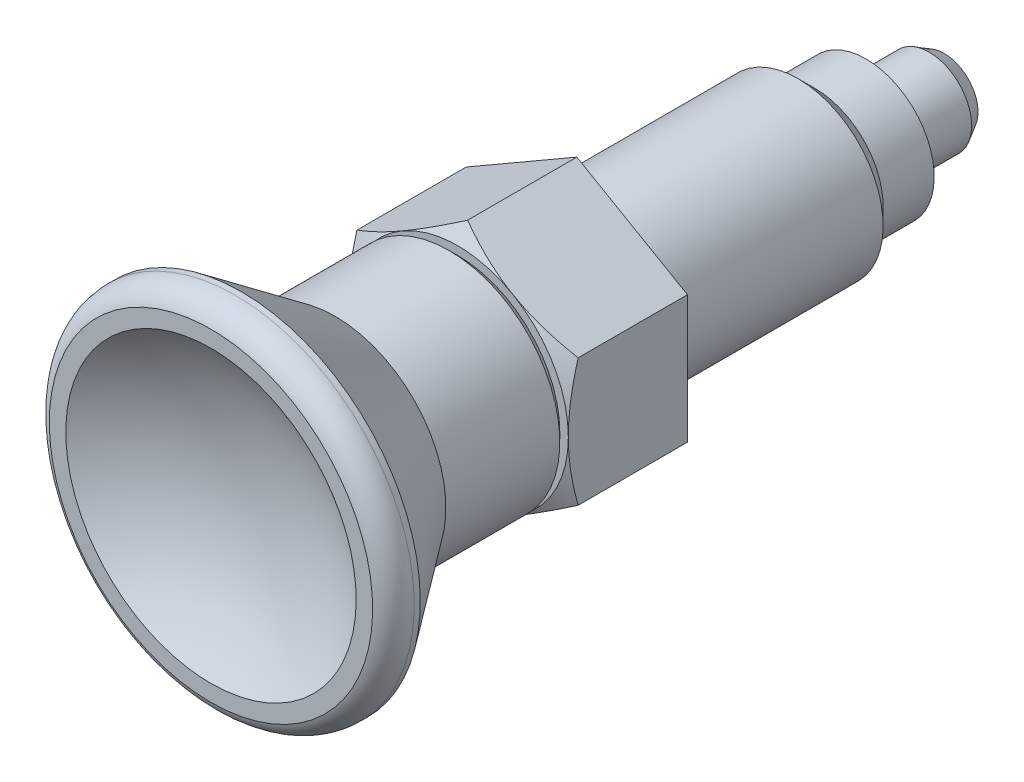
ISO-10303-21;
HEADER;
FILE_DESCRIPTION(('STEP AP214'),'2;1');
FILE_NAME('part.step','',(''),(''),'','','');
FILE_SCHEMA(('AUTOMOTIVE_DESIGN { 1 0 10303 214 1 1 1 1 }'));
ENDSEC;
DATA;
#1=APPLICATION_CONTEXT('core data for automotive mechanical design processes');
#2=APPLICATION_PROTOCOL_DEFINITION('international standard','automotive_design',2000,#1);
#3=PRODUCT_CONTEXT('',#1,'mechanical');
#4=PRODUCT('Part','Part','',(#3));
#5=PRODUCT_RELATED_PRODUCT_CATEGORY('part','',(#4));
#6=PRODUCT_DEFINITION_FORMATION('','',#4);
#7=PRODUCT_DEFINITION_CONTEXT('part definition',#1,'design');
#8=PRODUCT_DEFINITION('design','',#6,#7);
#9=PRODUCT_DEFINITION_SHAPE('','',#8);
#10=(LENGTH_UNIT() NAMED_UNIT(*) SI_UNIT(.MILLI.,.METRE.));
#11=(NAMED_UNIT(*) PLANE_ANGLE_UNIT() SI_UNIT($,.RADIAN.));
#12=(NAMED_UNIT(*) SI_UNIT($,.STERADIAN.) SOLID_ANGLE_UNIT());
#13=UNCERTAINTY_MEASURE_WITH_UNIT(LENGTH_MEASURE(1.E-05),#10,'distance_accuracy_value','');
#14=(GEOMETRIC_REPRESENTATION_CONTEXT(3) GLOBAL_UNCERTAINTY_ASSIGNED_CONTEXT((#13)) GLOBAL_UNIT_ASSIGNED_CONTEXT((#10,
#11,#12)) REPRESENTATION_CONTEXT('',''));
#15=CARTESIAN_POINT('',(0.,0.,0.));
#16=DIRECTION('',(0.,0.,1.));
#17=DIRECTION('',(1.,0.,0.));
#18=AXIS2_PLACEMENT_3D('',#15,#16,#17);
#19=CARTESIAN_POINT('',(0.,0.,32.6));
#20=DIRECTION('',(1.,0.,0.));
#21=DIRECTION('',(0.,-1.,0.));
#22=AXIS2_PLACEMENT_3D('',#19,#20,#21);
#23=SPHERICAL_SURFACE('',#22,14.);
#24=CARTESIAN_POINT('',(0.,-8.53170557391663,21.5));
#25=CARTESIAN_POINT('',(0.239701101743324,-8.53170729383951,21.5));
#26=CARTESIAN_POINT('',(0.479373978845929,-8.52159969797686,21.5));
#27=CARTESIAN_POINT('',(0.957096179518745,-8.48123987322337,21.5));
#28=CARTESIAN_POINT('',(1.19514505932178,-8.45098234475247,21.5));
#29=CARTESIAN_POINT('',(1.66809840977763,-8.37048717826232,21.5));
#30=CARTESIAN_POINT('',(1.90299924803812,-8.3202282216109,21.5));
#31=CARTESIAN_POINT('',(2.36773233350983,-8.20008811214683,21.5));
#32=CARTESIAN_POINT('',(2.59756451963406,-8.13020672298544,21.5));
#33=CARTESIAN_POINT('',(3.05040854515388,-7.97135842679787,21.5));
#34=CARTESIAN_POINT('',(3.27342368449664,-7.88240092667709,21.5));
#35=CARTESIAN_POINT('',(3.71116976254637,-7.68601114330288,21.5));
#36=CARTESIAN_POINT('',(3.92590057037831,-7.5785785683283,21.5));
#37=CARTESIAN_POINT('',(4.34545679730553,-7.34605366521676,21.5));
#38=CARTESIAN_POINT('',(4.55028643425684,-7.22096894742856,21.5));
#39=CARTESIAN_POINT('',(4.94875279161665,-6.95394741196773,21.5));
#40=CARTESIAN_POINT('',(5.14238561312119,-6.81200477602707,21.5));
#41=CARTESIAN_POINT('',(5.51699044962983,-6.51232267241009,21.5));
#42=CARTESIAN_POINT('',(5.69796342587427,-6.35458440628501,21.5));
#43=CARTESIAN_POINT('',(6.04598097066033,-6.0244208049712,21.5));
#44=CARTESIAN_POINT('',(6.21302532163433,-5.85199524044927,21.5));
#45=CARTESIAN_POINT('',(6.53199815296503,-5.49368132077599,21.5));
#46=CARTESIAN_POINT('',(6.6839263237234,-5.30779269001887,21.5));
#47=CARTESIAN_POINT('',(6.97158596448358,-4.92387306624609,21.5));
#48=CARTESIAN_POINT('',(7.10731707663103,-4.72584180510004,21.5));
#49=CARTESIAN_POINT('',(7.36158785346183,-4.31908993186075,21.5));
#50=CARTESIAN_POINT('',(7.48013099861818,-4.11037149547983,21.5));
#51=CARTESIAN_POINT('',(7.69925411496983,-3.68361770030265,21.5));
#52=CARTESIAN_POINT('',(7.79982785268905,-3.46557914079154,21.5));
#53=CARTESIAN_POINT('',(7.98222972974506,-3.02184395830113,21.5));
#54=CARTESIAN_POINT('',(8.06406129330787,-2.79614874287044,21.5));
#55=CARTESIAN_POINT('',(8.20842175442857,-2.33866337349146,21.5));
#56=CARTESIAN_POINT('',(8.27095035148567,-2.10687312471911,21.5));
#57=CARTESIAN_POINT('',(8.37625770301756,-1.63885297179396,21.5));
#58=CARTESIAN_POINT('',(8.41903679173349,-1.40262314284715,21.5));
#59=CARTESIAN_POINT('',(8.48454328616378,-0.927394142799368,21.5));
#60=CARTESIAN_POINT('',(8.5072702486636,-0.688394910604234,21.5));
#61=CARTESIAN_POINT('',(8.53250695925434,-0.209376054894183,21.5));
#62=CARTESIAN_POINT('',(8.53502046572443,0.0306433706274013,21.5));
#63=CARTESIAN_POINT('',(8.5198196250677,0.510124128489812,21.5));
#64=CARTESIAN_POINT('',(8.50209827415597,0.749585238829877,21.5));
#65=CARTESIAN_POINT('',(8.44654739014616,1.22611973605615,21.5));
#66=CARTESIAN_POINT('',(8.40872148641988,1.46319354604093,21.5));
#67=CARTESIAN_POINT('',(8.31323191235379,1.93331562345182,21.5));
#68=CARTESIAN_POINT('',(8.25556793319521,2.16636382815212,21.5));
#69=CARTESIAN_POINT('',(8.12081350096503,2.62676991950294,21.5));
#70=CARTESIAN_POINT('',(8.04372339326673,2.85412790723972,21.5));
#71=CARTESIAN_POINT('',(7.87066231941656,3.30154649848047,21.5));
#72=CARTESIAN_POINT('',(7.77469093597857,3.52160694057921,21.5));
#73=CARTESIAN_POINT('',(7.56457013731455,3.95282077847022,21.5));
#74=CARTESIAN_POINT('',(7.45042407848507,4.16397580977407,21.5));
#75=CARTESIAN_POINT('',(7.20470986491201,4.57599267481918,21.5));
#76=CARTESIAN_POINT('',(7.07313569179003,4.77685091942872,21.5));
#77=CARTESIAN_POINT('',(6.79355690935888,5.16673175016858,21.5));
#78=CARTESIAN_POINT('',(6.64555528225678,5.35575647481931,21.5));
#79=CARTESIAN_POINT('',(6.33415193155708,5.72066897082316,21.5));
#80=CARTESIAN_POINT('',(6.17074996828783,5.89655653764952,21.5));
#81=CARTESIAN_POINT('',(5.82971281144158,6.23393780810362,21.5));
#82=CARTESIAN_POINT('',(5.65207788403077,6.3954317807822,21.5));
#83=CARTESIAN_POINT('',(5.28383088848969,6.70288487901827,21.5));
#84=CARTESIAN_POINT('',(5.09321853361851,6.84884366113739,21.5));
#85=CARTESIAN_POINT('',(4.70041160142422,7.1241591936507,21.5));
#86=CARTESIAN_POINT('',(4.49821916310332,7.25351899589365,21.5));
#87=CARTESIAN_POINT('',(4.08358517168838,7.49479054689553,21.5));
#88=CARTESIAN_POINT('',(3.87114009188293,7.60669623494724,21.5));
#89=CARTESIAN_POINT('',(3.43761429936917,7.81219183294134,21.5));
#90=CARTESIAN_POINT('',(3.2165350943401,7.90578492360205,21.5));
#91=CARTESIAN_POINT('',(2.76727776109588,8.07401431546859,21.5));
#92=CARTESIAN_POINT('',(2.53909962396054,8.14865059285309,21.5));
#93=CARTESIAN_POINT('',(2.07727024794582,8.27843463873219,21.5));
#94=CARTESIAN_POINT('',(1.84361908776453,8.33358268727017,21.5));
#95=CARTESIAN_POINT('',(1.37249510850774,8.42400095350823,21.5));
#96=CARTESIAN_POINT('',(1.13502218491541,8.45927062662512,21.5));
#97=CARTESIAN_POINT('',(0.657949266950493,8.50967905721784,21.5));
#98=CARTESIAN_POINT('',(0.4183492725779,8.52481781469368,21.5));
#99=CARTESIAN_POINT('',(-0.0612677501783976,8.53485664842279,21.5));
#100=CARTESIAN_POINT('',(-0.301284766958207,8.52975727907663,21.5));
#101=CARTESIAN_POINT('',(-0.780039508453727,8.49935713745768,21.5));
#102=CARTESIAN_POINT('',(-1.01877721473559,8.47405607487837,21.5));
#103=CARTESIAN_POINT('',(-1.49327224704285,8.40343211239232,21.5));
#104=CARTESIAN_POINT('',(-1.72902957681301,8.3581092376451,21.5));
#105=CARTESIAN_POINT('',(-2.19592874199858,8.24775425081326,21.5));
#106=CARTESIAN_POINT('',(-2.42706976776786,8.18271871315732,21.5));
#107=CARTESIAN_POINT('',(-2.88297114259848,8.03342958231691,21.5));
#108=CARTESIAN_POINT('',(-3.10773367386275,7.94918265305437,21.5));
#109=CARTESIAN_POINT('',(-3.54940485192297,7.76203966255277,21.5));
#110=CARTESIAN_POINT('',(-3.76631204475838,7.65914016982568,21.5));
#111=CARTESIAN_POINT('',(-4.19068207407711,7.43543649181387,21.5));
#112=CARTESIAN_POINT('',(-4.39814511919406,7.31463270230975,21.5));
#113=CARTESIAN_POINT('',(-4.8021608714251,7.0559751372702,21.5));
#114=CARTESIAN_POINT('',(-4.99871337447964,6.91812104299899,21.5));
#115=CARTESIAN_POINT('',(-5.37950346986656,6.62634702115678,21.5));
#116=CARTESIAN_POINT('',(-5.56374125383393,6.47242734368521,21.5));
#117=CARTESIAN_POINT('',(-5.91862768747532,6.14958531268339,21.5));
#118=CARTESIAN_POINT('',(-6.08927386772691,5.9806602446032,21.5));
#119=CARTESIAN_POINT('',(-6.41566976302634,5.62909362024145,21.5));
#120=CARTESIAN_POINT('',(-6.57142461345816,5.44645683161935,21.5));
#121=CARTESIAN_POINT('',(-6.86702506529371,5.06867846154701,21.5));
#122=CARTESIAN_POINT('',(-7.00686772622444,4.873534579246,21.5));
#123=CARTESIAN_POINT('',(-7.26961345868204,4.47216416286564,21.5));
#124=CARTESIAN_POINT('',(-7.39251690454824,4.26593787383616,21.5));
#125=CARTESIAN_POINT('',(-7.62051616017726,3.84386102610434,21.5));
#126=CARTESIAN_POINT('',(-7.72561165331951,3.62801029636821,21.5));
#127=CARTESIAN_POINT('',(-7.917243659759,3.18822603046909,21.5));
#128=CARTESIAN_POINT('',(-8.00378046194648,2.96429262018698,21.5));
#129=CARTESIAN_POINT('',(-8.15769585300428,2.5098907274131,21.5));
#130=CARTESIAN_POINT('',(-8.22507098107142,2.27942107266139,21.5));
#131=CARTESIAN_POINT('',(-8.34014309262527,1.81370520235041,21.5));
#132=CARTESIAN_POINT('',(-8.38784687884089,1.57846066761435,21.5));
#133=CARTESIAN_POINT('',(-8.46327786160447,1.10474543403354,21.5));
#134=CARTESIAN_POINT('',(-8.49100134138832,0.866274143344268,21.5));
#135=CARTESIAN_POINT('',(-8.52625974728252,0.387849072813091,21.5));
#136=CARTESIAN_POINT('',(-8.53379511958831,0.147895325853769,21.5));
#137=CARTESIAN_POINT('',(-8.5286249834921,-0.331798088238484,21.5));
#138=CARTESIAN_POINT('',(-8.51591913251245,-0.571537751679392,21.5));
#139=CARTESIAN_POINT('',(-8.4703566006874,-1.04909074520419,21.5));
#140=CARTESIAN_POINT('',(-8.43750023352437,-1.28690410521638,21.5));
#141=CARTESIAN_POINT('',(-8.35186267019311,-1.75896084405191,21.5));
#142=CARTESIAN_POINT('',(-8.29907783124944,-1.99320356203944,21.5));
#143=CARTESIAN_POINT('',(-8.17398097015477,-2.45632829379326,21.5));
#144=CARTESIAN_POINT('',(-8.10167571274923,-2.68521213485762,21.5));
#145=CARTESIAN_POINT('',(-7.93802712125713,-3.1361221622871,21.5));
#146=CARTESIAN_POINT('',(-7.84667992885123,-3.35814694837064,21.5));
#147=CARTESIAN_POINT('',(-7.64560805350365,-3.79370687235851,21.5));
#148=CARTESIAN_POINT('',(-7.53588377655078,-4.00724219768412,21.5));
#149=CARTESIAN_POINT('',(-7.29883882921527,-4.42430601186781,21.5));
#150=CARTESIAN_POINT('',(-7.1715185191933,-4.62783470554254,21.5));
#151=CARTESIAN_POINT('',(-6.90018708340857,-5.02343989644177,21.5));
#152=CARTESIAN_POINT('',(-6.75617621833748,-5.21551657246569,21.5));
#153=CARTESIAN_POINT('',(-6.45247425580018,-5.58686986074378,21.5));
#154=CARTESIAN_POINT('',(-6.29278196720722,-5.76614549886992,21.5));
#155=CARTESIAN_POINT('',(-5.95891965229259,-6.11054627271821,21.5));
#156=CARTESIAN_POINT('',(-5.78475465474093,-6.2756762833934,21.5));
#157=CARTESIAN_POINT('',(-5.42305871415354,-6.5907497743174,21.5));
#158=CARTESIAN_POINT('',(-5.23552205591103,-6.74068669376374,21.5));
#159=CARTESIAN_POINT('',(-4.84848604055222,-7.02422451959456,21.5));
#160=CARTESIAN_POINT('',(-4.64898687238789,-7.15782568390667,21.5));
#161=CARTESIAN_POINT('',(-4.23934049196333,-7.4078063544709,21.5));
#162=CARTESIAN_POINT('',(-4.02918808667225,-7.5241773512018,21.5));
#163=CARTESIAN_POINT('',(-3.59982553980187,-7.73878930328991,21.5));
#164=CARTESIAN_POINT('',(-3.38061550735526,-7.83703047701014,21.5));
#165=CARTESIAN_POINT('',(-2.93492880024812,-8.01459089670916,21.5));
#166=CARTESIAN_POINT('',(-2.7084601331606,-8.09393023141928,21.5));
#167=CARTESIAN_POINT('',(-2.24972197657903,-8.23323823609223,21.5));
#168=CARTESIAN_POINT('',(-2.01745402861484,-8.29321199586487,21.5));
#169=CARTESIAN_POINT('',(-1.49030380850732,-8.40586518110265,21.5));
#170=CARTESIAN_POINT('',(-1.1942237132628,-8.45301528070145,21.5));
#171=CARTESIAN_POINT('',(-0.598747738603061,-8.51593440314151,21.5));
#172=CARTESIAN_POINT('',(-0.29935185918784,-8.53170342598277,21.5));
#173=CARTESIAN_POINT('',(0.,-8.53170557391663,21.5));
#174=B_SPLINE_CURVE_WITH_KNOTS('',3,(#24,#25,#26,#27,#28,#29,#30,#31,#32,#33,#34,#35,#36,#37,
#38,#39,#40,#41,#42,#43,#44,#45,#46,#47,#48,#49,#50,#51,#52,#53,#54,#55,#56,#57,#58,#59,#60,#61,
#62,#63,#64,#65,#66,#67,#68,#69,#70,#71,#72,#73,#74,#75,#76,#77,#78,#79,#80,#81,#82,#83,#84,#85,
#86,#87,#88,#89,#90,#91,#92,#93,#94,#95,#96,#97,#98,#99,#100,#101,#102,#103,#104,#105,#106,#107,
#108,#109,#110,#111,#112,#113,#114,#115,#116,#117,#118,#119,#120,#121,#122,#123,#124,#125,#126,
#127,#128,#129,#130,#131,#132,#133,#134,#135,#136,#137,#138,#139,#140,#141,#142,#143,#144,#145,
#146,#147,#148,#149,#150,#151,#152,#153,#154,#155,#156,#157,#158,#159,#160,#161,#162,#163,#164,
#165,#166,#167,#168,#169,#170,#171,#172,#173),.UNSPECIFIED.,.T.,.F.,(4,2,2,2,2,2,2,2,2,2,2,2,2,
2,2,2,2,2,2,2,2,2,2,2,2,2,2,2,2,2,2,2,2,2,2,2,2,2,2,2,2,2,2,2,2,2,2,2,2,2,2,2,2,2,2,2,2,2,2,2,2,
2,2,2,2,2,2,2,2,2,2,2,2,2,4),(0.,0.718841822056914,1.43787277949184,2.15767218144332,
2.87748025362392,3.59693418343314,4.31639947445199,5.03555552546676,5.75496050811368,
6.47431080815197,7.19367234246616,7.9130486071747,8.63244076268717,9.35168704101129,
10.0711823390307,10.790546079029,11.5099210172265,12.2292837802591,12.9486624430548,
13.6679073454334,14.387401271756,15.1067653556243,15.8261406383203,16.5455031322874,
17.2648815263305,17.9841272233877,18.7036219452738,19.422986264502,20.1423617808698,
20.8617238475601,21.5811018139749,22.3003473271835,23.0198420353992,23.7392116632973,
24.4585821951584,25.1779423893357,25.8973222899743,26.616702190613,27.3360623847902,
28.0554329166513,28.7748025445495,29.4942972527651,30.2135427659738,30.9329207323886,
31.6522827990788,32.3716583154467,33.0910226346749,33.8105173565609,34.5297630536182,
35.2491414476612,35.9685039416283,36.6878792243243,37.4072433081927,38.1267372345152,
38.8459821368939,39.5653607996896,40.2847235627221,41.0040985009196,41.7234622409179,
42.4429575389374,43.1622038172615,43.8815959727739,44.6009722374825,45.3203337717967,
46.039684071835,46.7590890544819,47.4782451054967,48.1977103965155,48.9171643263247,
49.6369723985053,50.3567718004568,51.0758027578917,51.7946445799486,52.6923736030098,
53.5901026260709),.UNSPECIFIED.);
#175=CARTESIAN_POINT('',(0.,-8.53170557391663,21.5));
#176=VERTEX_POINT('',#175);
#177=EDGE_CURVE('E19',#176,#176,#174,.T.);
#178=ORIENTED_EDGE('',*,*,#177,.T.);
#179=EDGE_LOOP('',(#178));
#180=FACE_BOUND('',#179,.T.);
#181=ADVANCED_FACE('F14',(#180),#23,.F.);
#182=CARTESIAN_POINT('',(-8.53170557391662,0.,21.5));
#183=DIRECTION('',(0.,0.,-1.));
#184=DIRECTION('',(0.,-1.,0.));
#185=AXIS2_PLACEMENT_3D('',#182,#183,#184);
#186=PLANE('',#185);
#187=ORIENTED_EDGE('',*,*,#177,.F.);
#188=EDGE_LOOP('',(#187));
#189=FACE_BOUND('',#188,.T.);
#190=CARTESIAN_POINT('',(0.,0.,21.5));
#191=DIRECTION('',(0.,0.,-1.));
#192=DIRECTION('',(0.,-1.,0.));
#193=AXIS2_PLACEMENT_3D('',#190,#191,#192);
#194=CIRCLE('',#193,9.50000000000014);
#195=CARTESIAN_POINT('',(0.,-9.50000000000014,21.5));
#196=VERTEX_POINT('',#195);
#197=EDGE_CURVE('E422',#196,#196,#194,.T.);
#198=ORIENTED_EDGE('',*,*,#197,.F.);
#199=EDGE_LOOP('',(#198));
#200=FACE_BOUND('',#199,.T.);
#201=ADVANCED_FACE('F357',(#189,#200),#186,.F.);
#202=CARTESIAN_POINT('',(0.,0.,-17.));
#203=DIRECTION('',(1.,0.,0.));
#204=DIRECTION('',(0.,-1.,0.));
#205=AXIS2_PLACEMENT_3D('',#202,#203,#204);
#206=SPHERICAL_SURFACE('',#205,4.9999999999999);
#207=CARTESIAN_POINT('',(0.,0.,-21.5881225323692));
#208=DIRECTION('',(0.,0.,1.));
#209=DIRECTION('',(0.,1.,0.));
#210=AXIS2_PLACEMENT_3D('',#207,#208,#209);
#211=CIRCLE('',#210,1.9872422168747);
#212=CARTESIAN_POINT('',(0.,1.9872422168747,-21.5881225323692));
#213=VERTEX_POINT('',#212);
#214=EDGE_CURVE('E341',#213,#213,#211,.T.);
#215=ORIENTED_EDGE('',*,*,#214,.F.);
#216=EDGE_LOOP('',(#215));
#217=FACE_BOUND('',#216,.T.);
#218=ADVANCED_FACE('F353',(#217),#206,.T.);
#219=CARTESIAN_POINT('',(0.,0.,20.0857085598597));
#220=DIRECTION('',(0.,0.,-1.));
#221=DIRECTION('',(0.,-1.,0.));
#222=AXIS2_PLACEMENT_3D('',#219,#220,#221);
#223=TOROIDAL_SURFACE('',#222,9.0002203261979,1.5);
#224=CARTESIAN_POINT('',(0.,0.,20.06));
#225=DIRECTION('',(0.,0.,1.));
#226=DIRECTION('',(0.,1.,0.));
#227=AXIS2_PLACEMENT_3D('',#224,#225,#226);
#228=CIRCLE('',#227,10.5);
#229=CARTESIAN_POINT('',(0.,10.5,20.06));
#230=VERTEX_POINT('',#229);
#231=EDGE_CURVE('E336',#230,#230,#228,.F.);
#232=ORIENTED_EDGE('',*,*,#231,.F.);
#233=EDGE_LOOP('',(#232));
#234=FACE_BOUND('',#233,.T.);
#235=ORIENTED_EDGE('',*,*,#197,.T.);
#236=EDGE_LOOP('',(#235));
#237=FACE_BOUND('',#236,.T.);
#238=ADVANCED_FACE('F348',(#234,#237),#223,.T.);
#239=CARTESIAN_POINT('',(0.,0.,-20.7000000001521));
#240=DIRECTION('',(0.,0.,1.));
#241=DIRECTION('',(0.,1.,0.));
#242=AXIS2_PLACEMENT_3D('',#239,#240,#241);
#243=CONICAL_SURFACE('',#242,2.49999999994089,0.523598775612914);
#244=CARTESIAN_POINT('',(0.,0.,-20.7));
#245=DIRECTION('',(0.,0.,1.));
#246=DIRECTION('',(0.,1.,0.));
#247=AXIS2_PLACEMENT_3D('',#244,#245,#246);
#248=CIRCLE('',#247,2.5);
#249=CARTESIAN_POINT('',(0.,2.5,-20.7));
#250=VERTEX_POINT('',#249);
#251=EDGE_CURVE('E331',#250,#250,#248,.T.);
#252=ORIENTED_EDGE('',*,*,#251,.F.);
#253=EDGE_LOOP('',(#252));
#254=FACE_BOUND('',#253,.T.);
#255=ORIENTED_EDGE('',*,*,#214,.T.);
#256=EDGE_LOOP('',(#255));
#257=FACE_BOUND('',#256,.T.);
#258=ADVANCED_FACE('F352',(#254,#257),#243,.T.);
#259=CARTESIAN_POINT('',(0.,0.,-22.));
#260=DIRECTION('',(0.,0.,1.));
#261=DIRECTION('',(0.,1.,0.));
#262=AXIS2_PLACEMENT_3D('',#259,#260,#261);
#263=CYLINDRICAL_SURFACE('',#262,10.5);
#264=ORIENTED_EDGE('',*,*,#231,.T.);
#265=EDGE_LOOP('',(#264));
#266=FACE_BOUND('',#265,.T.);
#267=CARTESIAN_POINT('',(0.,0.,19.7));
#268=DIRECTION('',(0.,0.,1.));
#269=DIRECTION('',(0.,1.,0.));
#270=AXIS2_PLACEMENT_3D('',#267,#268,#269);
#271=CIRCLE('',#270,10.5);
#272=CARTESIAN_POINT('',(0.,10.5,19.7));
#273=VERTEX_POINT('',#272);
#274=EDGE_CURVE('E318',#273,#273,#271,.F.);
#275=ORIENTED_EDGE('',*,*,#274,.F.);
#276=EDGE_LOOP('',(#275));
#277=FACE_BOUND('',#276,.T.);
#278=ADVANCED_FACE('F430',(#266,#277),#263,.T.);
#279=CARTESIAN_POINT('',(0.,0.,-22.));
#280=DIRECTION('',(0.,0.,1.));
#281=DIRECTION('',(0.,1.,0.));
#282=AXIS2_PLACEMENT_3D('',#279,#280,#281);
#283=CYLINDRICAL_SURFACE('',#282,2.5);
#284=CARTESIAN_POINT('',(0.,0.,-17.3732050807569));
#285=DIRECTION('',(0.,0.,-1.));
#286=DIRECTION('',(0.,-1.,0.));
#287=AXIS2_PLACEMENT_3D('',#284,#285,#286);
#288=CIRCLE('',#287,2.5);
#289=CARTESIAN_POINT('',(0.,-2.5,-17.3732050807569));
#290=VERTEX_POINT('',#289);
#291=EDGE_CURVE('E315',#290,#290,#288,.T.);
#292=ORIENTED_EDGE('',*,*,#291,.T.);
#293=EDGE_LOOP('',(#292));
#294=FACE_BOUND('',#293,.T.);
#295=ORIENTED_EDGE('',*,*,#251,.T.);
#296=EDGE_LOOP('',(#295));
#297=FACE_BOUND('',#296,.T.);
#298=ADVANCED_FACE('F435',(#294,#297),#283,.T.);
#299=CARTESIAN_POINT('',(0.,0.,19.7));
#300=DIRECTION('',(0.,0.,1.));
#301=DIRECTION('',(0.,1.,0.));
#302=AXIS2_PLACEMENT_3D('',#299,#300,#301);
#303=CONICAL_SURFACE('',#302,10.5,0.628318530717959);
#304=ORIENTED_EDGE('',*,*,#274,.T.);
#305=EDGE_LOOP('',(#304));
#306=FACE_BOUND('',#305,.T.);
#307=CARTESIAN_POINT('',(0.,0.,14.1944723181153));
#308=DIRECTION('',(0.,0.,1.));
#309=DIRECTION('',(0.,1.,0.));
#310=AXIS2_PLACEMENT_3D('',#307,#308,#309);
#311=CIRCLE('',#310,6.5);
#312=CARTESIAN_POINT('',(0.,6.5,14.1944723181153));
#313=VERTEX_POINT('',#312);
#314=EDGE_CURVE('E284',#313,#313,#311,.F.);
#315=ORIENTED_EDGE('',*,*,#314,.F.);
#316=EDGE_LOOP('',(#315));
#317=FACE_BOUND('',#316,.T.);
#318=ADVANCED_FACE('F308',(#306,#317),#303,.T.);
#319=CARTESIAN_POINT('',(0.,0.,-17.2));
#320=DIRECTION('',(0.,0.,-1.));
#321=DIRECTION('',(0.,-1.,0.));
#322=AXIS2_PLACEMENT_3D('',#319,#320,#321);
#323=TOROIDAL_SURFACE('',#322,2.6,0.2);
#324=CARTESIAN_POINT('',(0.,0.,-17.));
#325=DIRECTION('',(0.,0.,-1.));
#326=DIRECTION('',(0.,-1.,0.));
#327=AXIS2_PLACEMENT_3D('',#324,#325,#326);
#328=CIRCLE('',#327,2.6);
#329=CARTESIAN_POINT('',(0.,-2.6,-17.));
#330=VERTEX_POINT('',#329);
#331=EDGE_CURVE('E273',#330,#330,#328,.T.);
#332=ORIENTED_EDGE('',*,*,#331,.T.);
#333=EDGE_LOOP('',(#332));
#334=FACE_BOUND('',#333,.T.);
#335=ORIENTED_EDGE('',*,*,#291,.F.);
#336=EDGE_LOOP('',(#335));
#337=FACE_BOUND('',#336,.T.);
#338=ADVANCED_FACE('F302',(#334,#337),#323,.F.);
#339=CARTESIAN_POINT('',(0.,0.,-22.));
#340=DIRECTION('',(0.,0.,1.));
#341=DIRECTION('',(0.,1.,0.));
#342=AXIS2_PLACEMENT_3D('',#339,#340,#341);
#343=CYLINDRICAL_SURFACE('',#342,6.5);
#344=ORIENTED_EDGE('',*,*,#314,.T.);
#345=EDGE_LOOP('',(#344));
#346=FACE_BOUND('',#345,.T.);
#347=CARTESIAN_POINT('',(0.,0.,7.49999999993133));
#348=DIRECTION('',(0.,0.,1.));
#349=DIRECTION('',(0.,1.,0.));
#350=AXIS2_PLACEMENT_3D('',#347,#348,#349);
#351=CIRCLE('',#350,6.49999999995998);
#352=CARTESIAN_POINT('',(0.,6.49999999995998,7.49999999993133));
#353=VERTEX_POINT('',#352);
#354=EDGE_CURVE('E269',#353,#353,#351,.F.);
#355=ORIENTED_EDGE('',*,*,#354,.F.);
#356=EDGE_LOOP('',(#355));
#357=FACE_BOUND('',#356,.T.);
#358=ADVANCED_FACE('F297',(#346,#357),#343,.T.);
#359=CARTESIAN_POINT('',(-2.7,0.,-17.));
#360=DIRECTION('',(0.,0.,1.));
#361=DIRECTION('',(0.,1.,0.));
#362=AXIS2_PLACEMENT_3D('',#359,#360,#361);
#363=PLANE('',#362);
#364=CARTESIAN_POINT('',(0.,0.,-17.0000000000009));
#365=DIRECTION('',(0.,0.,1.));
#366=DIRECTION('',(0.,1.,0.));
#367=AXIS2_PLACEMENT_3D('',#364,#365,#366);
#368=CIRCLE('',#367,2.69999999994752);
#369=CARTESIAN_POINT('',(0.,2.69999999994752,-17.0000000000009));
#370=VERTEX_POINT('',#369);
#371=EDGE_CURVE('E272',#370,#370,#368,.T.);
#372=ORIENTED_EDGE('',*,*,#371,.F.);
#373=EDGE_LOOP('',(#372));
#374=FACE_BOUND('',#373,.T.);
#375=ORIENTED_EDGE('',*,*,#331,.F.);
#376=EDGE_LOOP('',(#375));
#377=FACE_BOUND('',#376,.T.);
#378=ADVANCED_FACE('F286',(#374,#377),#363,.F.);
#379=CARTESIAN_POINT('',(0.,0.,7.49999999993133));
#380=DIRECTION('',(0.,0.,1.));
#381=DIRECTION('',(0.,1.,0.));
#382=AXIS2_PLACEMENT_3D('',#379,#380,#381);
#383=CONICAL_SURFACE('',#382,6.49999999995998,0.785398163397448);
#384=ORIENTED_EDGE('',*,*,#354,.T.);
#385=EDGE_LOOP('',(#384));
#386=FACE_BOUND('',#385,.T.);
#387=CARTESIAN_POINT('',(0.,0.,6.99999999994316));
#388=DIRECTION('',(0.,0.,1.));
#389=DIRECTION('',(0.,1.,0.));
#390=AXIS2_PLACEMENT_3D('',#387,#388,#389);
#391=CIRCLE('',#390,5.99999999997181);
#392=CARTESIAN_POINT('',(0.,5.99999999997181,6.99999999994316));
#393=VERTEX_POINT('',#392);
#394=EDGE_CURVE('E266',#393,#393,#391,.F.);
#395=ORIENTED_EDGE('',*,*,#394,.F.);
#396=EDGE_LOOP('',(#395));
#397=FACE_BOUND('',#396,.T.);
#398=ADVANCED_FACE('F296',(#386,#397),#383,.T.);
#399=CARTESIAN_POINT('',(0.,0.,-16.7000000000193));
#400=DIRECTION('',(0.,0.,1.));
#401=DIRECTION('',(0.,1.,0.));
#402=AXIS2_PLACEMENT_3D('',#399,#400,#401);
#403=CONICAL_SURFACE('',#402,2.99999999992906,0.785398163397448);
#404=CARTESIAN_POINT('',(0.,0.,-16.7));
#405=DIRECTION('',(0.,0.,1.));
#406=DIRECTION('',(0.,1.,0.));
#407=AXIS2_PLACEMENT_3D('',#404,#405,#406);
#408=CIRCLE('',#407,3.);
#409=CARTESIAN_POINT('',(0.,3.,-16.7));
#410=VERTEX_POINT('',#409);
#411=EDGE_CURVE('E99',#410,#410,#408,.F.);
#412=ORIENTED_EDGE('',*,*,#411,.T.);
#413=EDGE_LOOP('',(#412));
#414=FACE_BOUND('',#413,.T.);
#415=ORIENTED_EDGE('',*,*,#371,.T.);
#416=EDGE_LOOP('',(#415));
#417=FACE_BOUND('',#416,.T.);
#418=ADVANCED_FACE('F458',(#414,#417),#403,.T.);
#419=CARTESIAN_POINT('',(-6.5,0.,7.));
#420=DIRECTION('',(0.,0.,1.));
#421=DIRECTION('',(0.,1.,0.));
#422=AXIS2_PLACEMENT_3D('',#419,#420,#421);
#423=PLANE('',#422);
#424=CARTESIAN_POINT('',(0.,0.,7.));
#425=DIRECTION('',(0.,0.,-1.));
#426=DIRECTION('',(0.,-1.,0.));
#427=AXIS2_PLACEMENT_3D('',#424,#425,#426);
#428=CIRCLE('',#427,6.5);
#429=CARTESIAN_POINT('',(3.25,5.62916512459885,7.));
#430=VERTEX_POINT('',#429);
#431=CARTESIAN_POINT('',(6.5,0.,7.));
#432=VERTEX_POINT('',#431);
#433=EDGE_CURVE('E394',#430,#432,#428,.T.);
#434=ORIENTED_EDGE('',*,*,#433,.F.);
#435=CARTESIAN_POINT('',(0.,0.,7.));
#436=DIRECTION('',(0.,0.,-1.));
#437=DIRECTION('',(0.,-1.,0.));
#438=AXIS2_PLACEMENT_3D('',#435,#436,#437);
#439=CIRCLE('',#438,6.5);
#440=CARTESIAN_POINT('',(-3.25,5.62916512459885,7.));
#441=VERTEX_POINT('',#440);
#442=EDGE_CURVE('E397',#441,#430,#439,.T.);
#443=ORIENTED_EDGE('',*,*,#442,.F.);
#444=CARTESIAN_POINT('',(0.,0.,7.));
#445=DIRECTION('',(0.,0.,-1.));
#446=DIRECTION('',(0.,-1.,0.));
#447=AXIS2_PLACEMENT_3D('',#444,#445,#446);
#448=CIRCLE('',#447,6.5);
#449=CARTESIAN_POINT('',(-6.5,0.,7.));
#450=VERTEX_POINT('',#449);
#451=EDGE_CURVE('E94',#450,#441,#448,.T.);
#452=ORIENTED_EDGE('',*,*,#451,.F.);
#453=CARTESIAN_POINT('',(0.,0.,7.));
#454=DIRECTION('',(0.,0.,-1.));
#455=DIRECTION('',(0.,-1.,0.));
#456=AXIS2_PLACEMENT_3D('',#453,#454,#455);
#457=CIRCLE('',#456,6.5);
#458=CARTESIAN_POINT('',(-3.25,-5.62916512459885,7.));
#459=VERTEX_POINT('',#458);
#460=EDGE_CURVE('E87',#459,#450,#457,.T.);
#461=ORIENTED_EDGE('',*,*,#460,.F.);
#462=CARTESIAN_POINT('',(0.,0.,7.));
#463=DIRECTION('',(0.,0.,-1.));
#464=DIRECTION('',(0.,-1.,0.));
#465=AXIS2_PLACEMENT_3D('',#462,#463,#464);
#466=CIRCLE('',#465,6.5);
#467=CARTESIAN_POINT('',(3.25,-5.62916512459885,7.));
#468=VERTEX_POINT('',#467);
#469=EDGE_CURVE('E91',#468,#459,#466,.T.);
#470=ORIENTED_EDGE('',*,*,#469,.F.);
#471=CARTESIAN_POINT('',(0.,0.,7.));
#472=DIRECTION('',(0.,0.,-1.));
#473=DIRECTION('',(0.,-1.,0.));
#474=AXIS2_PLACEMENT_3D('',#471,#472,#473);
#475=CIRCLE('',#474,6.5);
#476=EDGE_CURVE('E111',#432,#468,#475,.T.);
#477=ORIENTED_EDGE('',*,*,#476,.F.);
#478=EDGE_LOOP('',(#434,#443,#452,#461,#470,#477));
#479=FACE_BOUND('',#478,.T.);
#480=ORIENTED_EDGE('',*,*,#394,.T.);
#481=EDGE_LOOP('',(#480));
#482=FACE_BOUND('',#481,.T.);
#483=ADVANCED_FACE('F89',(#479,#482),#423,.T.);
#484=CARTESIAN_POINT('',(0.,0.,-17.));
#485=DIRECTION('',(0.,0.,1.));
#486=DIRECTION('',(0.,1.,0.));
#487=AXIS2_PLACEMENT_3D('',#484,#485,#486);
#488=CYLINDRICAL_SURFACE('',#487,3.);
#489=ORIENTED_EDGE('',*,*,#411,.F.);
#490=EDGE_LOOP('',(#489));
#491=FACE_BOUND('',#490,.T.);
#492=CARTESIAN_POINT('',(0.,0.,-17.));
#493=DIRECTION('',(0.,0.,1.));
#494=DIRECTION('',(0.,1.,0.));
#495=AXIS2_PLACEMENT_3D('',#492,#493,#494);
#496=CIRCLE('',#495,3.);
#497=CARTESIAN_POINT('',(0.,3.,-17.));
#498=VERTEX_POINT('',#497);
#499=EDGE_CURVE('E110',#498,#498,#496,.T.);
#500=ORIENTED_EDGE('',*,*,#499,.F.);
#501=EDGE_LOOP('',(#500));
#502=FACE_BOUND('',#501,.T.);
#503=ADVANCED_FACE('F461',(#491,#502),#488,.F.);
#504=CARTESIAN_POINT('',(0.,0.,6.41596007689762));
#505=DIRECTION('',(0.,0.,-1.));
#506=DIRECTION('',(0.,-1.,0.));
#507=AXIS2_PLACEMENT_3D('',#504,#505,#506);
#508=CONICAL_SURFACE('',#507,7.51158682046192,1.0471975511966);
#509=CARTESIAN_POINT('',(-6.5,-3.75277674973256,6.41944341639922));
#510=CARTESIAN_POINT('',(-6.5,-3.44730232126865,6.50764841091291));
#511=CARTESIAN_POINT('',(-6.5,-3.1393815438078,6.58845958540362));
#512=CARTESIAN_POINT('',(-6.5,-2.52082569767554,6.73096863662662));
#513=CARTESIAN_POINT('',(-6.5,-2.21021220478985,6.7927610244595));
#514=CARTESIAN_POINT('',(-6.5,-1.74136052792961,6.8686315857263));
#515=CARTESIAN_POINT('',(-6.5,-1.58448437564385,6.89112797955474));
#516=CARTESIAN_POINT('',(-6.5,-1.26998104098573,6.93006970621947));
#517=CARTESIAN_POINT('',(-6.5,-1.11235387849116,6.94651519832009));
#518=CARTESIAN_POINT('',(-6.5,-0.795765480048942,6.97306617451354));
#519=CARTESIAN_POINT('',(-6.5,-0.636801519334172,6.98313941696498));
#520=CARTESIAN_POINT('',(-6.5,-0.318560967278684,6.99662027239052));
#521=CARTESIAN_POINT('',(-6.5,-0.159284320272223,7.00002656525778));
#522=CARTESIAN_POINT('',(-6.5,0.,7.));
#523=B_SPLINE_CURVE_WITH_KNOTS('',3,(#509,#510,#511,#512,#513,#514,#515,#516,#517,#518,#519,
#520,#521,#522),.UNSPECIFIED.,.F.,.F.,(4,2,2,2,2,2,4),(0.,0.954247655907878,1.90367376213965,
2.37900973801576,2.85433320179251,3.33204281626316,3.80984701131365),.UNSPECIFIED.);
#524=CARTESIAN_POINT('',(-6.5,-3.75277674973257,6.41944341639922));
#525=VERTEX_POINT('',#524);
#526=EDGE_CURVE('E116',#525,#450,#523,.T.);
#527=ORIENTED_EDGE('',*,*,#526,.F.);
#528=CARTESIAN_POINT('',(-3.25,-5.62916512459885,7.));
#529=CARTESIAN_POINT('',(-3.38794426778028,-5.54952296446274,7.00002656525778));
#530=CARTESIAN_POINT('',(-3.52588189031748,-5.46988464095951,6.99662027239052));
#531=CARTESIAN_POINT('',(-3.80148629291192,-5.31076436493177,6.98313941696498));
#532=CARTESIAN_POINT('',(-3.9391531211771,-5.23128238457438,6.97306617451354));
#533=CARTESIAN_POINT('',(-4.21332671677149,-5.07298818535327,6.94651519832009));
#534=CARTESIAN_POINT('',(-4.34983584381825,-4.99417460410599,6.93006970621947));
#535=CARTESIAN_POINT('',(-4.6222037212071,-4.83692293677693,6.89112797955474));
#536=CARTESIAN_POINT('',(-4.75806245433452,-4.75848486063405,6.8686315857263));
#537=CARTESIAN_POINT('',(-5.16409991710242,-4.52405902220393,6.7927610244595));
#538=CARTESIAN_POINT('',(-5.43309909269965,-4.36875227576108,6.73096863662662));
#539=CARTESIAN_POINT('',(-5.96878416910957,-4.05947435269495,6.58845958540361));
#540=CARTESIAN_POINT('',(-6.23545138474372,-3.90551396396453,6.50764841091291));
#541=CARTESIAN_POINT('',(-6.5,-3.75277674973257,6.41944341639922));
#542=B_SPLINE_CURVE_WITH_KNOTS('',3,(#528,#529,#530,#531,#532,#533,#534,#535,#536,#537,#538,
#539,#540,#541),.UNSPECIFIED.,.F.,.F.,(4,2,2,2,2,2,4),(0.,0.477804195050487,0.955513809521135,
1.43083727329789,1.906173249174,2.85559935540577,3.80984701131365),.UNSPECIFIED.);
#543=EDGE_CURVE('E113',#459,#525,#542,.T.);
#544=ORIENTED_EDGE('',*,*,#543,.F.);
#545=ORIENTED_EDGE('',*,*,#460,.T.);
#546=EDGE_LOOP('',(#527,#544,#545));
#547=FACE_BOUND('',#546,.T.);
#548=ADVANCED_FACE('F114',(#547),#508,.T.);
#549=CARTESIAN_POINT('',(0.,0.,6.41596007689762));
#550=DIRECTION('',(0.,0.,-1.));
#551=DIRECTION('',(0.,-1.,0.));
#552=AXIS2_PLACEMENT_3D('',#549,#550,#551);
#553=CONICAL_SURFACE('',#552,7.51158682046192,1.0471975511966);
#554=CARTESIAN_POINT('',(-6.5,0.,7.));
#555=CARTESIAN_POINT('',(-6.5,0.159284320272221,7.00002656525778));
#556=CARTESIAN_POINT('',(-6.5,0.318560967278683,6.99662027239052));
#557=CARTESIAN_POINT('',(-6.5,0.63680151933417,6.98313941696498));
#558=CARTESIAN_POINT('',(-6.5,0.79576548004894,6.97306617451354));
#559=CARTESIAN_POINT('',(-6.5,1.11235387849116,6.94651519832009));
#560=CARTESIAN_POINT('',(-6.5,1.26998104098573,6.93006970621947));
#561=CARTESIAN_POINT('',(-6.5,1.58448437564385,6.89112797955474));
#562=CARTESIAN_POINT('',(-6.5,1.7413605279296,6.8686315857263));
#563=CARTESIAN_POINT('',(-6.5,2.21021220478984,6.7927610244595));
#564=CARTESIAN_POINT('',(-6.5,2.52082569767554,6.73096863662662));
#565=CARTESIAN_POINT('',(-6.5,3.1393815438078,6.58845958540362));
#566=CARTESIAN_POINT('',(-6.5,3.44730232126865,6.50764841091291));
#567=CARTESIAN_POINT('',(-6.5,3.75277674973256,6.41944341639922));
#568=B_SPLINE_CURVE_WITH_KNOTS('',3,(#554,#555,#556,#557,#558,#559,#560,#561,#562,#563,#564,
#565,#566,#567),.UNSPECIFIED.,.F.,.F.,(4,2,2,2,2,2,4),(0.,0.477804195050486,0.955513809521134,
1.43083727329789,1.906173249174,2.85559935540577,3.80984701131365),.UNSPECIFIED.);
#569=CARTESIAN_POINT('',(-6.5,3.75277674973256,6.41944341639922));
#570=VERTEX_POINT('',#569);
#571=EDGE_CURVE('E243',#450,#570,#568,.T.);
#572=ORIENTED_EDGE('',*,*,#571,.F.);
#573=ORIENTED_EDGE('',*,*,#451,.T.);
#574=CARTESIAN_POINT('',(-6.5,3.75277674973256,6.41944341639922));
#575=CARTESIAN_POINT('',(-6.23545138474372,3.90551396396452,6.50764841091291));
#576=CARTESIAN_POINT('',(-5.96878416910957,4.05947435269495,6.58845958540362));
#577=CARTESIAN_POINT('',(-5.43309909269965,4.36875227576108,6.73096863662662));
#578=CARTESIAN_POINT('',(-5.16409991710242,4.52405902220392,6.7927610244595));
#579=CARTESIAN_POINT('',(-4.75806245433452,4.75848486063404,6.8686315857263));
#580=CARTESIAN_POINT('',(-4.6222037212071,4.83692293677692,6.89112797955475));
#581=CARTESIAN_POINT('',(-4.34983584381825,4.99417460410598,6.93006970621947));
#582=CARTESIAN_POINT('',(-4.21332671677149,5.07298818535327,6.94651519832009));
#583=CARTESIAN_POINT('',(-3.9391531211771,5.23128238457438,6.97306617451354));
#584=CARTESIAN_POINT('',(-3.80148629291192,5.31076436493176,6.98313941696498));
#585=CARTESIAN_POINT('',(-3.52588189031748,5.46988464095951,6.99662027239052));
#586=CARTESIAN_POINT('',(-3.38794426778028,5.54952296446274,7.00002656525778));
#587=CARTESIAN_POINT('',(-3.25,5.62916512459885,7.));
#588=B_SPLINE_CURVE_WITH_KNOTS('',3,(#574,#575,#576,#577,#578,#579,#580,#581,#582,#583,#584,
#585,#586,#587),.UNSPECIFIED.,.F.,.F.,(4,2,2,2,2,2,4),(0.,0.954247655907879,1.90367376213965,
2.37900973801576,2.85433320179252,3.33204281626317,3.80984701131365),.UNSPECIFIED.);
#589=EDGE_CURVE('E236',#570,#441,#588,.T.);
#590=ORIENTED_EDGE('',*,*,#589,.F.);
#591=EDGE_LOOP('',(#572,#573,#590));
#592=FACE_BOUND('',#591,.T.);
#593=ADVANCED_FACE('F213',(#592),#553,.T.);
#594=CARTESIAN_POINT('',(0.,0.,6.41596007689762));
#595=DIRECTION('',(0.,0.,-1.));
#596=DIRECTION('',(0.,-1.,0.));
#597=AXIS2_PLACEMENT_3D('',#594,#595,#596);
#598=CONICAL_SURFACE('',#597,7.51158682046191,1.0471975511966);
#599=CARTESIAN_POINT('',(-3.25,5.62916512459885,7.));
#600=CARTESIAN_POINT('',(-3.11205573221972,5.70880728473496,7.00002656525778));
#601=CARTESIAN_POINT('',(-2.97411810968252,5.78844560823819,6.99662027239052));
#602=CARTESIAN_POINT('',(-2.69851370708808,5.94756588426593,6.98313941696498));
#603=CARTESIAN_POINT('',(-2.5608468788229,6.02704786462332,6.97306617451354));
#604=CARTESIAN_POINT('',(-2.28667328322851,6.18534206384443,6.94651519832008));
#605=CARTESIAN_POINT('',(-2.15016415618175,6.26415564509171,6.93006970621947));
#606=CARTESIAN_POINT('',(-1.8777962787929,6.42140731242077,6.89112797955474));
#607=CARTESIAN_POINT('',(-1.74193754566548,6.49984538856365,6.86863158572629));
#608=CARTESIAN_POINT('',(-1.33590008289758,6.73427122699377,6.7927610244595));
#609=CARTESIAN_POINT('',(-1.06690090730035,6.88957797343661,6.73096863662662));
#610=CARTESIAN_POINT('',(-0.531215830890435,7.19885589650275,6.58845958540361));
#611=CARTESIAN_POINT('',(-0.264548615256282,7.35281628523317,6.50764841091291));
#612=CARTESIAN_POINT('',(0.,7.50555349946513,6.41944341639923));
#613=B_SPLINE_CURVE_WITH_KNOTS('',3,(#599,#600,#601,#602,#603,#604,#605,#606,#607,#608,#609,
#610,#611,#612),.UNSPECIFIED.,.F.,.F.,(4,2,2,2,2,2,4),(0.,0.477804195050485,0.955513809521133,
1.43083727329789,1.906173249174,2.85559935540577,3.80984701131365),.UNSPECIFIED.);
#614=CARTESIAN_POINT('',(0.,7.50555349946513,6.41944341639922));
#615=VERTEX_POINT('',#614);
#616=EDGE_CURVE('E218',#441,#615,#613,.T.);
#617=ORIENTED_EDGE('',*,*,#616,.F.);
#618=ORIENTED_EDGE('',*,*,#442,.T.);
#619=CARTESIAN_POINT('',(0.,7.50555349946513,6.41944341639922));
#620=CARTESIAN_POINT('',(0.264548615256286,7.35281628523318,6.50764841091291));
#621=CARTESIAN_POINT('',(0.531215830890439,7.19885589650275,6.58845958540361));
#622=CARTESIAN_POINT('',(1.06690090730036,6.88957797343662,6.73096863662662));
#623=CARTESIAN_POINT('',(1.33590008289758,6.73427122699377,6.79276102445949));
#624=CARTESIAN_POINT('',(1.74193754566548,6.49984538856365,6.86863158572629));
#625=CARTESIAN_POINT('',(1.87779627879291,6.42140731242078,6.89112797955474));
#626=CARTESIAN_POINT('',(2.15016415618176,6.26415564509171,6.93006970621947));
#627=CARTESIAN_POINT('',(2.28667328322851,6.18534206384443,6.94651519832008));
#628=CARTESIAN_POINT('',(2.5608468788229,6.02704786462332,6.97306617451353));
#629=CARTESIAN_POINT('',(2.69851370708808,5.94756588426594,6.98313941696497));
#630=CARTESIAN_POINT('',(2.97411810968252,5.78844560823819,6.99662027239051));
#631=CARTESIAN_POINT('',(3.11205573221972,5.70880728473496,7.00002656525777));
#632=CARTESIAN_POINT('',(3.25,5.62916512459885,7.));
#633=B_SPLINE_CURVE_WITH_KNOTS('',3,(#619,#620,#621,#622,#623,#624,#625,#626,#627,#628,#629,
#630,#631,#632),.UNSPECIFIED.,.F.,.F.,(4,2,2,2,2,2,4),(0.,0.954247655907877,1.90367376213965,
2.37900973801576,2.85433320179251,3.33204281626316,3.80984701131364),.UNSPECIFIED.);
#634=EDGE_CURVE('E224',#615,#430,#633,.T.);
#635=ORIENTED_EDGE('',*,*,#634,.F.);
#636=EDGE_LOOP('',(#617,#618,#635));
#637=FACE_BOUND('',#636,.T.);
#638=ADVANCED_FACE('F207',(#637),#598,.T.);
#639=CARTESIAN_POINT('',(0.,0.,6.41596007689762));
#640=DIRECTION('',(0.,0.,-1.));
#641=DIRECTION('',(0.,-1.,0.));
#642=AXIS2_PLACEMENT_3D('',#639,#640,#641);
#643=CONICAL_SURFACE('',#642,7.51158682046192,1.0471975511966);
#644=CARTESIAN_POINT('',(3.25,5.62916512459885,7.));
#645=CARTESIAN_POINT('',(3.38794426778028,5.54952296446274,7.00002656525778));
#646=CARTESIAN_POINT('',(3.52588189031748,5.46988464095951,6.99662027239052));
#647=CARTESIAN_POINT('',(3.80148629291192,5.31076436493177,6.98313941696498));
#648=CARTESIAN_POINT('',(3.9391531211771,5.23128238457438,6.97306617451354));
#649=CARTESIAN_POINT('',(4.21332671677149,5.07298818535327,6.94651519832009));
#650=CARTESIAN_POINT('',(4.34983584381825,4.99417460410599,6.93006970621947));
#651=CARTESIAN_POINT('',(4.6222037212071,4.83692293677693,6.89112797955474));
#652=CARTESIAN_POINT('',(4.75806245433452,4.75848486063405,6.8686315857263));
#653=CARTESIAN_POINT('',(5.16409991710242,4.52405902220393,6.7927610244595));
#654=CARTESIAN_POINT('',(5.43309909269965,4.36875227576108,6.73096863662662));
#655=CARTESIAN_POINT('',(5.96878416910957,4.05947435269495,6.58845958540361));
#656=CARTESIAN_POINT('',(6.23545138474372,3.90551396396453,6.50764841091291));
#657=CARTESIAN_POINT('',(6.5,3.75277674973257,6.41944341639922));
#658=B_SPLINE_CURVE_WITH_KNOTS('',3,(#644,#645,#646,#647,#648,#649,#650,#651,#652,#653,#654,
#655,#656,#657),.UNSPECIFIED.,.F.,.F.,(4,2,2,2,2,2,4),(0.,0.477804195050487,0.955513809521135,
1.43083727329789,1.906173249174,2.85559935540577,3.80984701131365),.UNSPECIFIED.);
#659=CARTESIAN_POINT('',(6.5,3.75277674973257,6.41944341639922));
#660=VERTEX_POINT('',#659);
#661=EDGE_CURVE('E197',#430,#660,#658,.T.);
#662=ORIENTED_EDGE('',*,*,#661,.F.);
#663=ORIENTED_EDGE('',*,*,#433,.T.);
#664=CARTESIAN_POINT('',(6.5,3.75277674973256,6.41944341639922));
#665=CARTESIAN_POINT('',(6.5,3.44730232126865,6.50764841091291));
#666=CARTESIAN_POINT('',(6.5,3.1393815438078,6.58845958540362));
#667=CARTESIAN_POINT('',(6.5,2.52082569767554,6.73096863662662));
#668=CARTESIAN_POINT('',(6.5,2.21021220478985,6.7927610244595));
#669=CARTESIAN_POINT('',(6.5,1.74136052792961,6.8686315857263));
#670=CARTESIAN_POINT('',(6.5,1.58448437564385,6.89112797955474));
#671=CARTESIAN_POINT('',(6.5,1.26998104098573,6.93006970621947));
#672=CARTESIAN_POINT('',(6.5,1.11235387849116,6.94651519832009));
#673=CARTESIAN_POINT('',(6.5,0.795765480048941,6.97306617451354));
#674=CARTESIAN_POINT('',(6.5,0.636801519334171,6.98313941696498));
#675=CARTESIAN_POINT('',(6.5,0.318560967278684,6.99662027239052));
#676=CARTESIAN_POINT('',(6.5,0.159284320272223,7.00002656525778));
#677=CARTESIAN_POINT('',(6.5,0.,7.));
#678=B_SPLINE_CURVE_WITH_KNOTS('',3,(#664,#665,#666,#667,#668,#669,#670,#671,#672,#673,#674,
#675,#676,#677),.UNSPECIFIED.,.F.,.F.,(4,2,2,2,2,2,4),(0.,0.954247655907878,1.90367376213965,
2.37900973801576,2.85433320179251,3.33204281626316,3.80984701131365),.UNSPECIFIED.);
#679=EDGE_CURVE('E189',#660,#432,#678,.T.);
#680=ORIENTED_EDGE('',*,*,#679,.F.);
#681=EDGE_LOOP('',(#662,#663,#680));
#682=FACE_BOUND('',#681,.T.);
#683=ADVANCED_FACE('F203',(#682),#643,.T.);
#684=CARTESIAN_POINT('',(0.,0.,6.41596007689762));
#685=DIRECTION('',(0.,0.,-1.));
#686=DIRECTION('',(0.,-1.,0.));
#687=AXIS2_PLACEMENT_3D('',#684,#685,#686);
#688=CONICAL_SURFACE('',#687,7.51158682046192,1.0471975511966);
#689=CARTESIAN_POINT('',(6.5,-3.75277674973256,6.41944341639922));
#690=CARTESIAN_POINT('',(6.23545138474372,-3.90551396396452,6.50764841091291));
#691=CARTESIAN_POINT('',(5.96878416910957,-4.05947435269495,6.58845958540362));
#692=CARTESIAN_POINT('',(5.43309909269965,-4.36875227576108,6.73096863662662));
#693=CARTESIAN_POINT('',(5.16409991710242,-4.52405902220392,6.7927610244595));
#694=CARTESIAN_POINT('',(4.75806245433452,-4.75848486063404,6.8686315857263));
#695=CARTESIAN_POINT('',(4.6222037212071,-4.83692293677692,6.89112797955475));
#696=CARTESIAN_POINT('',(4.34983584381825,-4.99417460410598,6.93006970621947));
#697=CARTESIAN_POINT('',(4.21332671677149,-5.07298818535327,6.94651519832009));
#698=CARTESIAN_POINT('',(3.9391531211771,-5.23128238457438,6.97306617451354));
#699=CARTESIAN_POINT('',(3.80148629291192,-5.31076436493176,6.98313941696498));
#700=CARTESIAN_POINT('',(3.52588189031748,-5.46988464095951,6.99662027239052));
#701=CARTESIAN_POINT('',(3.38794426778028,-5.54952296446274,7.00002656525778));
#702=CARTESIAN_POINT('',(3.25,-5.62916512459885,7.));
#703=B_SPLINE_CURVE_WITH_KNOTS('',3,(#689,#690,#691,#692,#693,#694,#695,#696,#697,#698,#699,
#700,#701,#702),.UNSPECIFIED.,.F.,.F.,(4,2,2,2,2,2,4),(0.,0.954247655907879,1.90367376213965,
2.37900973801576,2.85433320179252,3.33204281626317,3.80984701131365),.UNSPECIFIED.);
#704=CARTESIAN_POINT('',(6.5,-3.75277674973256,6.41944341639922));
#705=VERTEX_POINT('',#704);
#706=EDGE_CURVE('E159',#705,#468,#703,.T.);
#707=ORIENTED_EDGE('',*,*,#706,.F.);
#708=CARTESIAN_POINT('',(6.5,0.,7.));
#709=CARTESIAN_POINT('',(6.5,-0.159284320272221,7.00002656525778));
#710=CARTESIAN_POINT('',(6.5,-0.318560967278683,6.99662027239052));
#711=CARTESIAN_POINT('',(6.5,-0.636801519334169,6.98313941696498));
#712=CARTESIAN_POINT('',(6.5,-0.79576548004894,6.97306617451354));
#713=CARTESIAN_POINT('',(6.5,-1.11235387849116,6.94651519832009));
#714=CARTESIAN_POINT('',(6.5,-1.26998104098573,6.93006970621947));
#715=CARTESIAN_POINT('',(6.5,-1.58448437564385,6.89112797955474));
#716=CARTESIAN_POINT('',(6.5,-1.7413605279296,6.8686315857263));
#717=CARTESIAN_POINT('',(6.5,-2.21021220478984,6.7927610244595));
#718=CARTESIAN_POINT('',(6.5,-2.52082569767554,6.73096863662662));
#719=CARTESIAN_POINT('',(6.5,-3.1393815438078,6.58845958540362));
#720=CARTESIAN_POINT('',(6.5,-3.44730232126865,6.50764841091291));
#721=CARTESIAN_POINT('',(6.5,-3.75277674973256,6.41944341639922));
#722=B_SPLINE_CURVE_WITH_KNOTS('',3,(#708,#709,#710,#711,#712,#713,#714,#715,#716,#717,#718,
#719,#720,#721),.UNSPECIFIED.,.F.,.F.,(4,2,2,2,2,2,4),(0.,0.477804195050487,0.955513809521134,
1.43083727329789,1.906173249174,2.85559935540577,3.80984701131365),.UNSPECIFIED.);
#723=EDGE_CURVE('E183',#432,#705,#722,.T.);
#724=ORIENTED_EDGE('',*,*,#723,.F.);
#725=ORIENTED_EDGE('',*,*,#476,.T.);
#726=EDGE_LOOP('',(#707,#724,#725));
#727=FACE_BOUND('',#726,.T.);
#728=ADVANCED_FACE('F146',(#727),#688,.T.);
#729=CARTESIAN_POINT('',(0.,0.,6.41596007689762));
#730=DIRECTION('',(0.,0.,-1.));
#731=DIRECTION('',(0.,-1.,0.));
#732=AXIS2_PLACEMENT_3D('',#729,#730,#731);
#733=CONICAL_SURFACE('',#732,7.51158682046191,1.0471975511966);
#734=CARTESIAN_POINT('',(0.,-7.50555349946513,6.41944341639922));
#735=CARTESIAN_POINT('',(-0.264548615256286,-7.35281628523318,6.50764841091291));
#736=CARTESIAN_POINT('',(-0.531215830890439,-7.19885589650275,6.58845958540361));
#737=CARTESIAN_POINT('',(-1.06690090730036,-6.88957797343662,6.73096863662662));
#738=CARTESIAN_POINT('',(-1.33590008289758,-6.73427122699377,6.79276102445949));
#739=CARTESIAN_POINT('',(-1.74193754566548,-6.49984538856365,6.86863158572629));
#740=CARTESIAN_POINT('',(-1.87779627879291,-6.42140731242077,6.89112797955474));
#741=CARTESIAN_POINT('',(-2.15016415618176,-6.26415564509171,6.93006970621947));
#742=CARTESIAN_POINT('',(-2.28667328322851,-6.18534206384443,6.94651519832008));
#743=CARTESIAN_POINT('',(-2.5608468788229,-6.02704786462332,6.97306617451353));
#744=CARTESIAN_POINT('',(-2.69851370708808,-5.94756588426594,6.98313941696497));
#745=CARTESIAN_POINT('',(-2.97411810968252,-5.78844560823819,6.99662027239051));
#746=CARTESIAN_POINT('',(-3.11205573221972,-5.70880728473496,7.00002656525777));
#747=CARTESIAN_POINT('',(-3.25,-5.62916512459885,7.));
#748=B_SPLINE_CURVE_WITH_KNOTS('',3,(#734,#735,#736,#737,#738,#739,#740,#741,#742,#743,#744,
#745,#746,#747),.UNSPECIFIED.,.F.,.F.,(4,2,2,2,2,2,4),(0.,0.954247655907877,1.90367376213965,
2.37900973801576,2.85433320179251,3.33204281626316,3.80984701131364),.UNSPECIFIED.);
#749=CARTESIAN_POINT('',(0.,-7.50555349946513,6.41944341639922));
#750=VERTEX_POINT('',#749);
#751=EDGE_CURVE('E105',#750,#459,#748,.T.);
#752=ORIENTED_EDGE('',*,*,#751,.F.);
#753=CARTESIAN_POINT('',(3.25,-5.62916512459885,7.));
#754=CARTESIAN_POINT('',(3.11205573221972,-5.70880728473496,7.00002656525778));
#755=CARTESIAN_POINT('',(2.97411810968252,-5.78844560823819,6.99662027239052));
#756=CARTESIAN_POINT('',(2.69851370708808,-5.94756588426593,6.98313941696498));
#757=CARTESIAN_POINT('',(2.5608468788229,-6.02704786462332,6.97306617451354));
#758=CARTESIAN_POINT('',(2.28667328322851,-6.18534206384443,6.94651519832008));
#759=CARTESIAN_POINT('',(2.15016415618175,-6.26415564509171,6.93006970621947));
#760=CARTESIAN_POINT('',(1.8777962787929,-6.42140731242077,6.89112797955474));
#761=CARTESIAN_POINT('',(1.74193754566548,-6.49984538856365,6.86863158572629));
#762=CARTESIAN_POINT('',(1.33590008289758,-6.73427122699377,6.7927610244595));
#763=CARTESIAN_POINT('',(1.06690090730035,-6.88957797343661,6.73096863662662));
#764=CARTESIAN_POINT('',(0.531215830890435,-7.19885589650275,6.58845958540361));
#765=CARTESIAN_POINT('',(0.264548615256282,-7.35281628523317,6.50764841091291));
#766=CARTESIAN_POINT('',(0.,-7.50555349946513,6.41944341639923));
#767=B_SPLINE_CURVE_WITH_KNOTS('',3,(#753,#754,#755,#756,#757,#758,#759,#760,#761,#762,#763,
#764,#765,#766),.UNSPECIFIED.,.F.,.F.,(4,2,2,2,2,2,4),(0.,0.477804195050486,0.955513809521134,
1.43083727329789,1.906173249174,2.85559935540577,3.80984701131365),.UNSPECIFIED.);
#768=EDGE_CURVE('E108',#468,#750,#767,.T.);
#769=ORIENTED_EDGE('',*,*,#768,.F.);
#770=ORIENTED_EDGE('',*,*,#469,.T.);
#771=EDGE_LOOP('',(#752,#769,#770));
#772=FACE_BOUND('',#771,.T.);
#773=ADVANCED_FACE('F103',(#772),#733,.T.);
#774=CARTESIAN_POINT('',(-3.,0.,-17.));
#775=DIRECTION('',(0.,0.,-1.));
#776=DIRECTION('',(0.,-1.,0.));
#777=AXIS2_PLACEMENT_3D('',#774,#775,#776);
#778=PLANE('',#777);
#779=ORIENTED_EDGE('',*,*,#499,.T.);
#780=EDGE_LOOP('',(#779));
#781=FACE_BOUND('',#780,.T.);
#782=CARTESIAN_POINT('',(0.,0.,-17.));
#783=DIRECTION('',(0.,0.,1.));
#784=DIRECTION('',(0.,1.,0.));
#785=AXIS2_PLACEMENT_3D('',#782,#783,#784);
#786=CIRCLE('',#785,4.);
#787=CARTESIAN_POINT('',(0.,4.,-17.));
#788=VERTEX_POINT('',#787);
#789=EDGE_CURVE('E158',#788,#788,#786,.T.);
#790=ORIENTED_EDGE('',*,*,#789,.F.);
#791=EDGE_LOOP('',(#790));
#792=FACE_BOUND('',#791,.T.);
#793=ADVANCED_FACE('F145',(#781,#792),#778,.T.);
#794=CARTESIAN_POINT('',(-6.5,-3.75277674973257,0.));
#795=DIRECTION('',(-0.5,-0.866025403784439,0.));
#796=DIRECTION('',(0.866025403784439,-0.5,0.));
#797=AXIS2_PLACEMENT_3D('',#794,#795,#796);
#798=PLANE('',#797);
#799=ORIENTED_EDGE('',*,*,#751,.T.);
#800=ORIENTED_EDGE('',*,*,#543,.T.);
#801=DIRECTION('',(0.,0.,1.));
#802=VECTOR('',#801,1.);
#803=CARTESIAN_POINT('',(-6.5,-3.75277674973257,0.));
#804=LINE('',#803,#802);
#805=CARTESIAN_POINT('',(-6.5,-3.75277674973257,0.));
#806=VERTEX_POINT('',#805);
#807=EDGE_CURVE('E119',#806,#525,#804,.T.);
#808=ORIENTED_EDGE('',*,*,#807,.F.);
#809=DIRECTION('',(-0.866025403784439,0.5,0.));
#810=VECTOR('',#809,1.);
#811=CARTESIAN_POINT('',(0.,-7.50555349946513,0.));
#812=LINE('',#811,#810);
#813=CARTESIAN_POINT('',(0.,-7.50555349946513,0.));
#814=VERTEX_POINT('',#813);
#815=EDGE_CURVE('E253',#814,#806,#812,.T.);
#816=ORIENTED_EDGE('',*,*,#815,.F.);
#817=DIRECTION('',(0.,0.,1.));
#818=VECTOR('',#817,1.);
#819=CARTESIAN_POINT('',(0.,-7.50555349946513,0.));
#820=LINE('',#819,#818);
#821=EDGE_CURVE('E123',#750,#814,#820,.F.);
#822=ORIENTED_EDGE('',*,*,#821,.F.);
#823=EDGE_LOOP('',(#799,#800,#808,#816,#822));
#824=FACE_BOUND('',#823,.T.);
#825=ADVANCED_FACE('F121',(#824),#798,.T.);
#826=CARTESIAN_POINT('',(-6.5,3.75277674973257,0.));
#827=DIRECTION('',(-1.,0.,0.));
#828=DIRECTION('',(0.,-1.,0.));
#829=AXIS2_PLACEMENT_3D('',#826,#827,#828);
#830=PLANE('',#829);
#831=ORIENTED_EDGE('',*,*,#526,.T.);
#832=ORIENTED_EDGE('',*,*,#571,.T.);
#833=DIRECTION('',(0.,0.,1.));
#834=VECTOR('',#833,1.);
#835=CARTESIAN_POINT('',(-6.5,3.75277674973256,0.));
#836=LINE('',#835,#834);
#837=CARTESIAN_POINT('',(-6.5,3.75277674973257,0.));
#838=VERTEX_POINT('',#837);
#839=EDGE_CURVE('E240',#838,#570,#836,.T.);
#840=ORIENTED_EDGE('',*,*,#839,.F.);
#841=DIRECTION('',(0.,-1.,0.));
#842=VECTOR('',#841,1.);
#843=CARTESIAN_POINT('',(-6.5,0.,0.));
#844=LINE('',#843,#842);
#845=EDGE_CURVE('E256',#806,#838,#844,.F.);
#846=ORIENTED_EDGE('',*,*,#845,.F.);
#847=ORIENTED_EDGE('',*,*,#807,.T.);
#848=EDGE_LOOP('',(#831,#832,#840,#846,#847));
#849=FACE_BOUND('',#848,.T.);
#850=ADVANCED_FACE('F482',(#849),#830,.T.);
#851=CARTESIAN_POINT('',(0.,7.50555349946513,0.));
#852=DIRECTION('',(-0.5,0.866025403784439,0.));
#853=DIRECTION('',(-0.866025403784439,-0.5,0.));
#854=AXIS2_PLACEMENT_3D('',#851,#852,#853);
#855=PLANE('',#854);
#856=ORIENTED_EDGE('',*,*,#589,.T.);
#857=ORIENTED_EDGE('',*,*,#616,.T.);
#858=DIRECTION('',(0.,0.,1.));
#859=VECTOR('',#858,1.);
#860=CARTESIAN_POINT('',(0.,7.50555349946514,0.));
#861=LINE('',#860,#859);
#862=CARTESIAN_POINT('',(0.,7.50555349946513,0.));
#863=VERTEX_POINT('',#862);
#864=EDGE_CURVE('E230',#863,#615,#861,.T.);
#865=ORIENTED_EDGE('',*,*,#864,.F.);
#866=DIRECTION('',(0.866025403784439,0.5,0.));
#867=VECTOR('',#866,1.);
#868=CARTESIAN_POINT('',(-6.5,3.75277674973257,0.));
#869=LINE('',#868,#867);
#870=EDGE_CURVE('E259',#838,#863,#869,.T.);
#871=ORIENTED_EDGE('',*,*,#870,.F.);
#872=ORIENTED_EDGE('',*,*,#839,.T.);
#873=EDGE_LOOP('',(#856,#857,#865,#871,#872));
#874=FACE_BOUND('',#873,.T.);
#875=ADVANCED_FACE('F485',(#874),#855,.T.);
#876=CARTESIAN_POINT('',(6.5,3.75277674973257,0.));
#877=DIRECTION('',(0.5,0.866025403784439,0.));
#878=DIRECTION('',(-0.866025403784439,0.5,0.));
#879=AXIS2_PLACEMENT_3D('',#876,#877,#878);
#880=PLANE('',#879);
#881=ORIENTED_EDGE('',*,*,#634,.T.);
#882=ORIENTED_EDGE('',*,*,#661,.T.);
#883=DIRECTION('',(0.,0.,1.));
#884=VECTOR('',#883,1.);
#885=CARTESIAN_POINT('',(6.5,3.75277674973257,0.));
#886=LINE('',#885,#884);
#887=CARTESIAN_POINT('',(6.5,3.75277674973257,0.));
#888=VERTEX_POINT('',#887);
#889=EDGE_CURVE('E196',#888,#660,#886,.T.);
#890=ORIENTED_EDGE('',*,*,#889,.F.);
#891=DIRECTION('',(0.866025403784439,-0.5,0.));
#892=VECTOR('',#891,1.);
#893=CARTESIAN_POINT('',(0.,7.50555349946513,0.));
#894=LINE('',#893,#892);
#895=EDGE_CURVE('E252',#863,#888,#894,.T.);
#896=ORIENTED_EDGE('',*,*,#895,.F.);
#897=ORIENTED_EDGE('',*,*,#864,.T.);
#898=EDGE_LOOP('',(#881,#882,#890,#896,#897));
#899=FACE_BOUND('',#898,.T.);
#900=ADVANCED_FACE('F179',(#899),#880,.T.);
#901=CARTESIAN_POINT('',(6.5,-3.75277674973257,0.));
#902=DIRECTION('',(1.,0.,0.));
#903=DIRECTION('',(0.,1.,0.));
#904=AXIS2_PLACEMENT_3D('',#901,#902,#903);
#905=PLANE('',#904);
#906=ORIENTED_EDGE('',*,*,#679,.T.);
#907=ORIENTED_EDGE('',*,*,#723,.T.);
#908=DIRECTION('',(0.,0.,1.));
#909=VECTOR('',#908,1.);
#910=CARTESIAN_POINT('',(6.5,-3.75277674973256,0.));
#911=LINE('',#910,#909);
#912=CARTESIAN_POINT('',(6.5,-3.75277674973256,0.));
#913=VERTEX_POINT('',#912);
#914=EDGE_CURVE('E37',#913,#705,#911,.T.);
#915=ORIENTED_EDGE('',*,*,#914,.F.);
#916=DIRECTION('',(0.,-1.,0.));
#917=VECTOR('',#916,1.);
#918=CARTESIAN_POINT('',(6.5,0.,0.));
#919=LINE('',#918,#917);
#920=EDGE_CURVE('E249',#888,#913,#919,.T.);
#921=ORIENTED_EDGE('',*,*,#920,.F.);
#922=ORIENTED_EDGE('',*,*,#889,.T.);
#923=EDGE_LOOP('',(#906,#907,#915,#921,#922));
#924=FACE_BOUND('',#923,.T.);
#925=ADVANCED_FACE('F172',(#924),#905,.T.);
#926=CARTESIAN_POINT('',(0.,-7.50555349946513,0.));
#927=DIRECTION('',(0.5,-0.866025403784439,0.));
#928=DIRECTION('',(0.866025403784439,0.5,0.));
#929=AXIS2_PLACEMENT_3D('',#926,#927,#928);
#930=PLANE('',#929);
#931=ORIENTED_EDGE('',*,*,#706,.T.);
#932=ORIENTED_EDGE('',*,*,#768,.T.);
#933=ORIENTED_EDGE('',*,*,#821,.T.);
#934=DIRECTION('',(-0.866025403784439,-0.5,0.));
#935=VECTOR('',#934,1.);
#936=CARTESIAN_POINT('',(6.5,-3.75277674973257,0.));
#937=LINE('',#936,#935);
#938=EDGE_CURVE('E245',#913,#814,#937,.T.);
#939=ORIENTED_EDGE('',*,*,#938,.F.);
#940=ORIENTED_EDGE('',*,*,#914,.T.);
#941=EDGE_LOOP('',(#931,#932,#933,#939,#940));
#942=FACE_BOUND('',#941,.T.);
#943=ADVANCED_FACE('F166',(#942),#930,.T.);
#944=CARTESIAN_POINT('',(0.,0.,-17.));
#945=DIRECTION('',(0.,0.,1.));
#946=DIRECTION('',(0.,1.,0.));
#947=AXIS2_PLACEMENT_3D('',#944,#945,#946);
#948=CYLINDRICAL_SURFACE('',#947,4.);
#949=ORIENTED_EDGE('',*,*,#789,.T.);
#950=EDGE_LOOP('',(#949));
#951=FACE_BOUND('',#950,.T.);
#952=CARTESIAN_POINT('',(0.,0.,-13.9999999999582));
#953=DIRECTION('',(0.,0.,1.));
#954=DIRECTION('',(0.,1.,0.));
#955=AXIS2_PLACEMENT_3D('',#952,#953,#954);
#956=CIRCLE('',#955,4.0000000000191);
#957=CARTESIAN_POINT('',(0.,4.0000000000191,-13.9999999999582));
#958=VERTEX_POINT('',#957);
#959=EDGE_CURVE('E248',#958,#958,#956,.T.);
#960=ORIENTED_EDGE('',*,*,#959,.F.);
#961=EDGE_LOOP('',(#960));
#962=FACE_BOUND('',#961,.T.);
#963=ADVANCED_FACE('F171',(#951,#962),#948,.T.);
#964=CARTESIAN_POINT('',(-5.,0.,0.));
#965=DIRECTION('',(0.,0.,-1.));
#966=DIRECTION('',(0.,-1.,0.));
#967=AXIS2_PLACEMENT_3D('',#964,#965,#966);
#968=PLANE('',#967);
#969=CARTESIAN_POINT('',(0.,0.,0.));
#970=DIRECTION('',(0.,0.,1.));
#971=DIRECTION('',(0.,1.,0.));
#972=AXIS2_PLACEMENT_3D('',#969,#970,#971);
#973=CIRCLE('',#972,5.);
#974=CARTESIAN_POINT('',(0.,5.,0.));
#975=VERTEX_POINT('',#974);
#976=EDGE_CURVE('E28',#975,#975,#973,.F.);
#977=ORIENTED_EDGE('',*,*,#976,.F.);
#978=EDGE_LOOP('',(#977));
#979=FACE_BOUND('',#978,.T.);
#980=ORIENTED_EDGE('',*,*,#920,.T.);
#981=ORIENTED_EDGE('',*,*,#938,.T.);
#982=ORIENTED_EDGE('',*,*,#815,.T.);
#983=ORIENTED_EDGE('',*,*,#845,.T.);
#984=ORIENTED_EDGE('',*,*,#870,.T.);
#985=ORIENTED_EDGE('',*,*,#895,.T.);
#986=EDGE_LOOP('',(#980,#981,#982,#983,#984,#985));
#987=FACE_BOUND('',#986,.T.);
#988=ADVANCED_FACE('F377',(#979,#987),#968,.T.);
#989=CARTESIAN_POINT('',(0.,0.,-12.9999999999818));
#990=DIRECTION('',(0.,0.,1.));
#991=DIRECTION('',(0.,1.,0.));
#992=AXIS2_PLACEMENT_3D('',#989,#990,#991);
#993=CONICAL_SURFACE('',#992,4.99999999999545,0.785398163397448);
#994=ORIENTED_EDGE('',*,*,#959,.T.);
#995=EDGE_LOOP('',(#994));
#996=FACE_BOUND('',#995,.T.);
#997=CARTESIAN_POINT('',(0.,0.,-13.));
#998=DIRECTION('',(0.,0.,1.));
#999=DIRECTION('',(0.,1.,0.));
#1000=AXIS2_PLACEMENT_3D('',#997,#998,#999);
#1001=CIRCLE('',#1000,5.);
#1002=CARTESIAN_POINT('',(0.,5.,-13.));
#1003=VERTEX_POINT('',#1002);
#1004=EDGE_CURVE('E9',#1003,#1003,#1001,.T.);
#1005=ORIENTED_EDGE('',*,*,#1004,.F.);
#1006=EDGE_LOOP('',(#1005));
#1007=FACE_BOUND('',#1006,.T.);
#1008=ADVANCED_FACE('F371',(#996,#1007),#993,.T.);
#1009=CARTESIAN_POINT('',(0.,0.,-17.));
#1010=DIRECTION('',(0.,0.,1.));
#1011=DIRECTION('',(0.,1.,0.));
#1012=AXIS2_PLACEMENT_3D('',#1009,#1010,#1011);
#1013=CYLINDRICAL_SURFACE('',#1012,5.);
#1014=ORIENTED_EDGE('',*,*,#1004,.T.);
#1015=EDGE_LOOP('',(#1014));
#1016=FACE_BOUND('',#1015,.T.);
#1017=ORIENTED_EDGE('',*,*,#976,.T.);
#1018=EDGE_LOOP('',(#1017));
#1019=FACE_BOUND('',#1018,.T.);
#1020=ADVANCED_FACE('F369',(#1016,#1019),#1013,.T.);
#1021=CLOSED_SHELL('',(#181,#201,#218,#238,#258,#278,#298,#318,#338,#358,#378,#398,#418,#483,
#503,#548,#593,#638,#683,#728,#773,#793,#825,#850,#875,#900,#925,#943,#963,#988,#1008,#1020));
#1022=MANIFOLD_SOLID_BREP('B1',#1021);
#1023=ADVANCED_BREP_SHAPE_REPRESENTATION('',(#18,#1022),#14);
#1024=SHAPE_DEFINITION_REPRESENTATION(#9,#1023);
ENDSEC;
END-ISO-10303-21;
